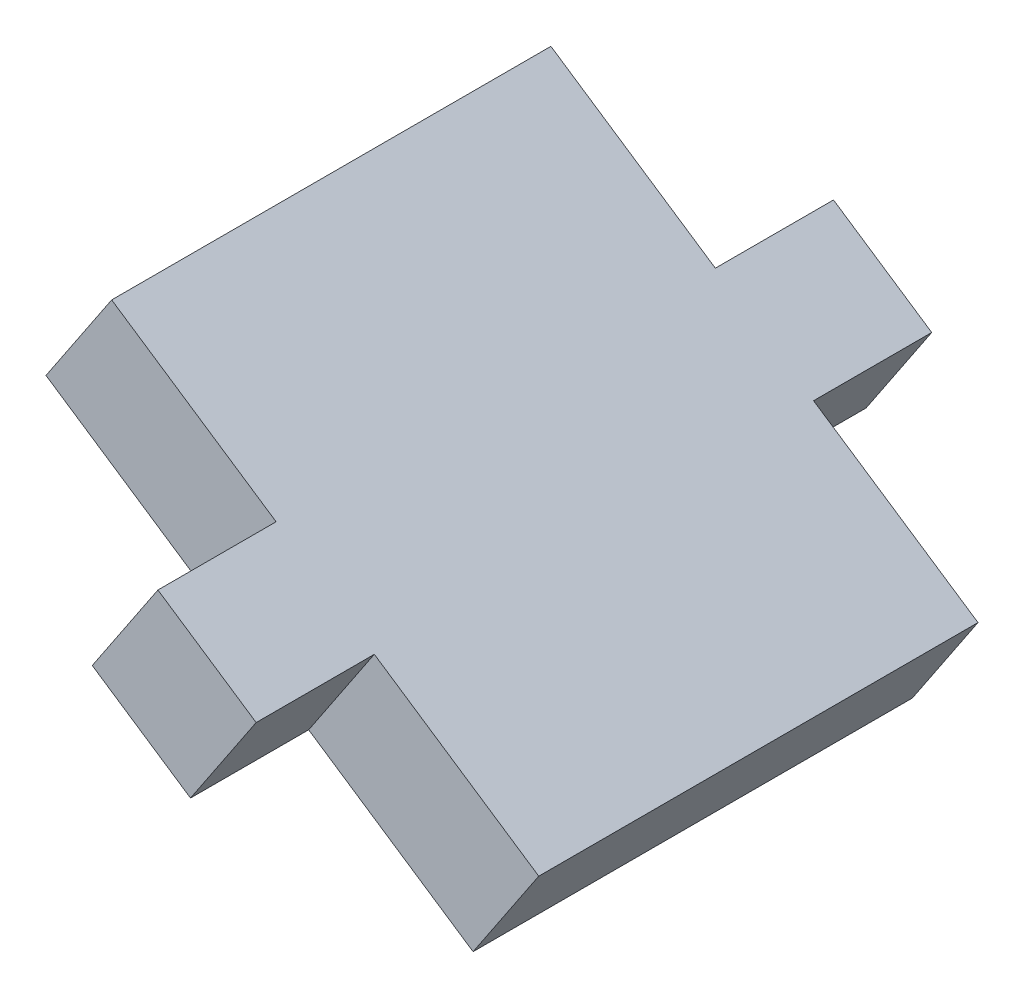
ISO-10303-21;
HEADER;
FILE_DESCRIPTION(('STEP AP214'),'2;1');
FILE_NAME('part.step','',(''),(''),'','','');
FILE_SCHEMA(('AUTOMOTIVE_DESIGN { 1 0 10303 214 1 1 1 1 }'));
ENDSEC;
DATA;
#1=APPLICATION_CONTEXT('core data for automotive mechanical design processes');
#2=APPLICATION_PROTOCOL_DEFINITION('international standard','automotive_design',2000,#1);
#3=PRODUCT_CONTEXT('',#1,'mechanical');
#4=PRODUCT('Part','Part','',(#3));
#5=PRODUCT_RELATED_PRODUCT_CATEGORY('part','',(#4));
#6=PRODUCT_DEFINITION_FORMATION('','',#4);
#7=PRODUCT_DEFINITION_CONTEXT('part definition',#1,'design');
#8=PRODUCT_DEFINITION('design','',#6,#7);
#9=PRODUCT_DEFINITION_SHAPE('','',#8);
#10=(LENGTH_UNIT() NAMED_UNIT(*) SI_UNIT(.MILLI.,.METRE.));
#11=(NAMED_UNIT(*) PLANE_ANGLE_UNIT() SI_UNIT($,.RADIAN.));
#12=(NAMED_UNIT(*) SI_UNIT($,.STERADIAN.) SOLID_ANGLE_UNIT());
#13=UNCERTAINTY_MEASURE_WITH_UNIT(LENGTH_MEASURE(1.E-05),#10,'distance_accuracy_value','');
#14=(GEOMETRIC_REPRESENTATION_CONTEXT(3) GLOBAL_UNCERTAINTY_ASSIGNED_CONTEXT((#13)) GLOBAL_UNIT_ASSIGNED_CONTEXT((#10,
#11,#12)) REPRESENTATION_CONTEXT('',''));
#15=CARTESIAN_POINT('',(0.,0.,0.));
#16=DIRECTION('',(0.,0.,1.));
#17=DIRECTION('',(1.,0.,0.));
#18=AXIS2_PLACEMENT_3D('',#15,#16,#17);
#19=CARTESIAN_POINT('',(0.,0.,-20.0152));
#20=DIRECTION('',(0.,0.,-1.));
#21=DIRECTION('',(-1.,0.,0.));
#22=AXIS2_PLACEMENT_3D('',#19,#20,#21);
#23=PLANE('',#22);
#24=DIRECTION('',(0.555746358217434,0.831351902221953,0.));
#25=VECTOR('',#24,1.);
#26=CARTESIAN_POINT('',(-748.95505416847,311.088970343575,-20.0152));
#27=LINE('',#26,#25);
#28=CARTESIAN_POINT('',(-748.95505416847,311.088970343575,-20.0152));
#29=VERTEX_POINT('',#28);
#30=CARTESIAN_POINT('',(-745.962471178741,315.56563406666,-20.0152));
#31=VERTEX_POINT('',#30);
#32=EDGE_CURVE('E49',#29,#31,#27,.T.);
#33=ORIENTED_EDGE('',*,*,#32,.F.);
#34=DIRECTION('',(0.83135190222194,-0.555746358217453,0.));
#35=VECTOR('',#34,1.);
#36=CARTESIAN_POINT('',(-756.447535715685,316.097582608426,-20.0152));
#37=LINE('',#36,#35);
#38=CARTESIAN_POINT('',(-756.447535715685,316.097582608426,-20.0152));
#39=VERTEX_POINT('',#38);
#40=EDGE_CURVE('E211',#39,#29,#37,.T.);
#41=ORIENTED_EDGE('',*,*,#40,.F.);
#42=DIRECTION('',(0.555746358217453,0.83135190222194,0.));
#43=VECTOR('',#42,1.);
#44=CARTESIAN_POINT('',(-756.447535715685,316.097582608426,-20.0152));
#45=LINE('',#44,#43);
#46=CARTESIAN_POINT('',(-753.454952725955,320.574246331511,-20.0152));
#47=VERTEX_POINT('',#46);
#48=EDGE_CURVE('E199',#39,#47,#45,.T.);
#49=ORIENTED_EDGE('',*,*,#48,.T.);
#50=DIRECTION('',(0.83135190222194,-0.555746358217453,0.));
#51=VECTOR('',#50,1.);
#52=CARTESIAN_POINT('',(-753.454952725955,320.574246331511,-20.0152));
#53=LINE('',#52,#51);
#54=EDGE_CURVE('E192',#47,#31,#53,.T.);
#55=ORIENTED_EDGE('',*,*,#54,.T.);
#56=EDGE_LOOP('',(#33,#41,#49,#55));
#57=FACE_BOUND('',#56,.T.);
#58=ADVANCED_FACE('F32',(#57),#23,.T.);
#59=CARTESIAN_POINT('',(0.,0.,0.));
#60=DIRECTION('',(0.,0.,-1.));
#61=DIRECTION('',(-1.,0.,0.));
#62=AXIS2_PLACEMENT_3D('',#59,#60,#61);
#63=PLANE('',#62);
#64=DIRECTION('',(-0.555746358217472,-0.831351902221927,0.));
#65=VECTOR('',#64,1.);
#66=CARTESIAN_POINT('',(-748.955053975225,311.088970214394,0.));
#67=LINE('',#66,#65);
#68=CARTESIAN_POINT('',(-745.962470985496,315.565633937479,0.));
#69=VERTEX_POINT('',#68);
#70=CARTESIAN_POINT('',(-748.955053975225,311.088970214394,0.));
#71=VERTEX_POINT('',#70);
#72=EDGE_CURVE('E148',#69,#71,#67,.T.);
#73=ORIENTED_EDGE('',*,*,#72,.F.);
#74=DIRECTION('',(0.83135190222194,-0.555746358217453,0.));
#75=VECTOR('',#74,1.);
#76=CARTESIAN_POINT('',(-753.454952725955,320.574246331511,0.));
#77=LINE('',#76,#75);
#78=CARTESIAN_POINT('',(-753.454952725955,320.574246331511,0.));
#79=VERTEX_POINT('',#78);
#80=EDGE_CURVE('E242',#79,#69,#77,.T.);
#81=ORIENTED_EDGE('',*,*,#80,.F.);
#82=DIRECTION('',(0.555746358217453,0.83135190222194,0.));
#83=VECTOR('',#82,1.);
#84=CARTESIAN_POINT('',(-756.447535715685,316.097582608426,0.));
#85=LINE('',#84,#83);
#86=CARTESIAN_POINT('',(-756.447535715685,316.097582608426,0.));
#87=VERTEX_POINT('',#86);
#88=EDGE_CURVE('E206',#87,#79,#85,.T.);
#89=ORIENTED_EDGE('',*,*,#88,.F.);
#90=DIRECTION('',(0.83135190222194,-0.555746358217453,0.));
#91=VECTOR('',#90,1.);
#92=CARTESIAN_POINT('',(-756.447535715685,316.097582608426,0.));
#93=LINE('',#92,#91);
#94=EDGE_CURVE('E235',#87,#71,#93,.T.);
#95=ORIENTED_EDGE('',*,*,#94,.T.);
#96=EDGE_LOOP('',(#73,#81,#89,#95));
#97=FACE_BOUND('',#96,.T.);
#98=ADVANCED_FACE('F278',(#97),#63,.F.);
#99=DIRECTION('',(0.555746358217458,0.831351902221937,0.));
#100=VECTOR('',#99,1.);
#101=CARTESIAN_POINT('',(-744.478390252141,308.096387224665,0.));
#102=LINE('',#101,#100);
#103=CARTESIAN_POINT('',(-744.478390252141,308.096387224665,0.));
#104=VERTEX_POINT('',#103);
#105=CARTESIAN_POINT('',(-741.485807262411,312.573050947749,0.));
#106=VERTEX_POINT('',#105);
#107=EDGE_CURVE('E151',#104,#106,#102,.T.);
#108=ORIENTED_EDGE('',*,*,#107,.F.);
#109=CARTESIAN_POINT('',(-736.985908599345,303.087774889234,0.));
#110=VERTEX_POINT('',#109);
#111=EDGE_CURVE('E237',#104,#110,#93,.T.);
#112=ORIENTED_EDGE('',*,*,#111,.T.);
#113=DIRECTION('',(-0.555746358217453,-0.83135190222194,0.));
#114=VECTOR('',#113,1.);
#115=CARTESIAN_POINT('',(-733.993325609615,307.564438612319,0.));
#116=LINE('',#115,#114);
#117=CARTESIAN_POINT('',(-733.993325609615,307.564438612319,0.));
#118=VERTEX_POINT('',#117);
#119=EDGE_CURVE('E230',#118,#110,#116,.T.);
#120=ORIENTED_EDGE('',*,*,#119,.F.);
#121=EDGE_CURVE('E246',#106,#118,#77,.T.);
#122=ORIENTED_EDGE('',*,*,#121,.F.);
#123=EDGE_LOOP('',(#108,#112,#120,#122));
#124=FACE_BOUND('',#123,.T.);
#125=ADVANCED_FACE('F276',(#124),#63,.F.);
#126=CARTESIAN_POINT('',(-756.447535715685,316.097582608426,-20.0152));
#127=DIRECTION('',(0.83135190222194,-0.555746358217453,0.));
#128=DIRECTION('',(0.555746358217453,0.83135190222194,0.));
#129=AXIS2_PLACEMENT_3D('',#126,#127,#128);
#130=PLANE('',#129);
#131=ORIENTED_EDGE('',*,*,#88,.T.);
#132=DIRECTION('',(0.,0.,1.));
#133=VECTOR('',#132,1.);
#134=CARTESIAN_POINT('',(-753.454952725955,320.574246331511,-20.0152));
#135=LINE('',#134,#133);
#136=EDGE_CURVE('E11',#47,#79,#135,.T.);
#137=ORIENTED_EDGE('',*,*,#136,.F.);
#138=ORIENTED_EDGE('',*,*,#48,.F.);
#139=DIRECTION('',(0.,0.,1.));
#140=VECTOR('',#139,1.);
#141=CARTESIAN_POINT('',(-756.447535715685,316.097582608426,-20.0152));
#142=LINE('',#141,#140);
#143=EDGE_CURVE('E212',#39,#87,#142,.T.);
#144=ORIENTED_EDGE('',*,*,#143,.T.);
#145=EDGE_LOOP('',(#131,#137,#138,#144));
#146=FACE_BOUND('',#145,.T.);
#147=ADVANCED_FACE('F34',(#146),#130,.F.);
#148=CARTESIAN_POINT('',(-753.454952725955,320.574246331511,-20.0152));
#149=DIRECTION('',(-0.555746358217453,-0.83135190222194,0.));
#150=DIRECTION('',(0.83135190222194,-0.555746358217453,0.));
#151=AXIS2_PLACEMENT_3D('',#148,#149,#150);
#152=PLANE('',#151);
#153=ORIENTED_EDGE('',*,*,#80,.T.);
#154=DIRECTION('',(0.,0.,-1.));
#155=VECTOR('',#154,1.);
#156=CARTESIAN_POINT('',(-745.962470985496,315.565633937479,5.3848));
#157=LINE('',#156,#155);
#158=CARTESIAN_POINT('',(-745.962470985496,315.565633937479,5.3848));
#159=VERTEX_POINT('',#158);
#160=EDGE_CURVE('E178',#159,#69,#157,.T.);
#161=ORIENTED_EDGE('',*,*,#160,.F.);
#162=DIRECTION('',(-0.831351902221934,0.555746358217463,0.));
#163=VECTOR('',#162,1.);
#164=CARTESIAN_POINT('',(-741.485807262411,312.573050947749,5.3848));
#165=LINE('',#164,#163);
#166=CARTESIAN_POINT('',(-741.485807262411,312.573050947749,5.3848));
#167=VERTEX_POINT('',#166);
#168=EDGE_CURVE('E176',#167,#159,#165,.T.);
#169=ORIENTED_EDGE('',*,*,#168,.F.);
#170=DIRECTION('',(0.,0.,-1.));
#171=VECTOR('',#170,1.);
#172=CARTESIAN_POINT('',(-741.485807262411,312.573050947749,5.3848));
#173=LINE('',#172,#171);
#174=EDGE_CURVE('E189',#167,#106,#173,.T.);
#175=ORIENTED_EDGE('',*,*,#174,.T.);
#176=ORIENTED_EDGE('',*,*,#121,.T.);
#177=DIRECTION('',(0.,0.,1.));
#178=VECTOR('',#177,1.);
#179=CARTESIAN_POINT('',(-733.993325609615,307.564438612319,-20.0152));
#180=LINE('',#179,#178);
#181=CARTESIAN_POINT('',(-733.993325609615,307.564438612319,-20.0152));
#182=VERTEX_POINT('',#181);
#183=EDGE_CURVE('E41',#182,#118,#180,.T.);
#184=ORIENTED_EDGE('',*,*,#183,.F.);
#185=CARTESIAN_POINT('',(-741.485807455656,312.573051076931,-20.0152));
#186=VERTEX_POINT('',#185);
#187=EDGE_CURVE('E147',#186,#182,#53,.T.);
#188=ORIENTED_EDGE('',*,*,#187,.F.);
#189=DIRECTION('',(0.,0.,1.));
#190=VECTOR('',#189,1.);
#191=CARTESIAN_POINT('',(-741.485807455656,312.573051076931,-25.4));
#192=LINE('',#191,#190);
#193=CARTESIAN_POINT('',(-741.485807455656,312.573051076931,-25.4));
#194=VERTEX_POINT('',#193);
#195=EDGE_CURVE('E128',#194,#186,#192,.T.);
#196=ORIENTED_EDGE('',*,*,#195,.F.);
#197=DIRECTION('',(0.831351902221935,-0.555746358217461,0.));
#198=VECTOR('',#197,1.);
#199=CARTESIAN_POINT('',(-745.962471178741,315.56563406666,-25.4));
#200=LINE('',#199,#198);
#201=CARTESIAN_POINT('',(-745.962471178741,315.56563406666,-25.4));
#202=VERTEX_POINT('',#201);
#203=EDGE_CURVE('E134',#202,#194,#200,.T.);
#204=ORIENTED_EDGE('',*,*,#203,.F.);
#205=DIRECTION('',(0.,0.,1.));
#206=VECTOR('',#205,1.);
#207=CARTESIAN_POINT('',(-745.962471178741,315.56563406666,-25.4));
#208=LINE('',#207,#206);
#209=EDGE_CURVE('E162',#202,#31,#208,.T.);
#210=ORIENTED_EDGE('',*,*,#209,.T.);
#211=ORIENTED_EDGE('',*,*,#54,.F.);
#212=ORIENTED_EDGE('',*,*,#136,.T.);
#213=EDGE_LOOP('',(#153,#161,#169,#175,#176,#184,#188,#196,#204,#210,#211,#212));
#214=FACE_BOUND('',#213,.T.);
#215=ADVANCED_FACE('F145',(#214),#152,.F.);
#216=CARTESIAN_POINT('',(-733.993325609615,307.564438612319,-20.0152));
#217=DIRECTION('',(-0.83135190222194,0.555746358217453,0.));
#218=DIRECTION('',(-0.555746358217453,-0.83135190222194,0.));
#219=AXIS2_PLACEMENT_3D('',#216,#217,#218);
#220=PLANE('',#219);
#221=ORIENTED_EDGE('',*,*,#119,.T.);
#222=DIRECTION('',(0.,0.,1.));
#223=VECTOR('',#222,1.);
#224=CARTESIAN_POINT('',(-736.985908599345,303.087774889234,-20.0152));
#225=LINE('',#224,#223);
#226=CARTESIAN_POINT('',(-736.985908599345,303.087774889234,-20.0152));
#227=VERTEX_POINT('',#226);
#228=EDGE_CURVE('E216',#227,#110,#225,.T.);
#229=ORIENTED_EDGE('',*,*,#228,.F.);
#230=DIRECTION('',(-0.555746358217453,-0.83135190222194,0.));
#231=VECTOR('',#230,1.);
#232=CARTESIAN_POINT('',(-733.993325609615,307.564438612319,-20.0152));
#233=LINE('',#232,#231);
#234=EDGE_CURVE('E195',#182,#227,#233,.T.);
#235=ORIENTED_EDGE('',*,*,#234,.F.);
#236=ORIENTED_EDGE('',*,*,#183,.T.);
#237=EDGE_LOOP('',(#221,#229,#235,#236));
#238=FACE_BOUND('',#237,.T.);
#239=ADVANCED_FACE('F228',(#238),#220,.F.);
#240=CARTESIAN_POINT('',(-756.447535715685,316.097582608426,-20.0152));
#241=DIRECTION('',(-0.555746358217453,-0.83135190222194,0.));
#242=DIRECTION('',(0.83135190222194,-0.555746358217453,0.));
#243=AXIS2_PLACEMENT_3D('',#240,#241,#242);
#244=PLANE('',#243);
#245=ORIENTED_EDGE('',*,*,#94,.F.);
#246=ORIENTED_EDGE('',*,*,#143,.F.);
#247=ORIENTED_EDGE('',*,*,#40,.T.);
#248=DIRECTION('',(0.,0.,1.));
#249=VECTOR('',#248,1.);
#250=CARTESIAN_POINT('',(-748.95505416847,311.088970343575,-25.4));
#251=LINE('',#250,#249);
#252=CARTESIAN_POINT('',(-748.95505416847,311.088970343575,-25.4));
#253=VERTEX_POINT('',#252);
#254=EDGE_CURVE('E153',#253,#29,#251,.T.);
#255=ORIENTED_EDGE('',*,*,#254,.F.);
#256=DIRECTION('',(-0.83135190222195,0.555746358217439,0.));
#257=VECTOR('',#256,1.);
#258=CARTESIAN_POINT('',(-744.478390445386,308.096387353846,-25.4));
#259=LINE('',#258,#257);
#260=CARTESIAN_POINT('',(-744.478390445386,308.096387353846,-25.4));
#261=VERTEX_POINT('',#260);
#262=EDGE_CURVE('E133',#261,#253,#259,.T.);
#263=ORIENTED_EDGE('',*,*,#262,.F.);
#264=DIRECTION('',(0.,0.,1.));
#265=VECTOR('',#264,1.);
#266=CARTESIAN_POINT('',(-744.478390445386,308.096387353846,-25.4));
#267=LINE('',#266,#265);
#268=CARTESIAN_POINT('',(-744.478390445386,308.096387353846,-20.0152));
#269=VERTEX_POINT('',#268);
#270=EDGE_CURVE('E130',#261,#269,#267,.T.);
#271=ORIENTED_EDGE('',*,*,#270,.T.);
#272=EDGE_CURVE('E203',#269,#227,#37,.T.);
#273=ORIENTED_EDGE('',*,*,#272,.T.);
#274=ORIENTED_EDGE('',*,*,#228,.T.);
#275=ORIENTED_EDGE('',*,*,#111,.F.);
#276=DIRECTION('',(0.,0.,-1.));
#277=VECTOR('',#276,1.);
#278=CARTESIAN_POINT('',(-744.478390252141,308.096387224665,5.3848));
#279=LINE('',#278,#277);
#280=CARTESIAN_POINT('',(-744.478390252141,308.096387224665,5.3848));
#281=VERTEX_POINT('',#280);
#282=EDGE_CURVE('E256',#281,#104,#279,.T.);
#283=ORIENTED_EDGE('',*,*,#282,.F.);
#284=DIRECTION('',(0.83135190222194,-0.555746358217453,0.));
#285=VECTOR('',#284,1.);
#286=CARTESIAN_POINT('',(-748.955053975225,311.088970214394,5.3848));
#287=LINE('',#286,#285);
#288=CARTESIAN_POINT('',(-748.955053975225,311.088970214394,5.3848));
#289=VERTEX_POINT('',#288);
#290=EDGE_CURVE('E172',#289,#281,#287,.T.);
#291=ORIENTED_EDGE('',*,*,#290,.F.);
#292=DIRECTION('',(0.,0.,-1.));
#293=VECTOR('',#292,1.);
#294=CARTESIAN_POINT('',(-748.955053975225,311.088970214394,5.3848));
#295=LINE('',#294,#293);
#296=EDGE_CURVE('E251',#289,#71,#295,.T.);
#297=ORIENTED_EDGE('',*,*,#296,.T.);
#298=EDGE_LOOP('',(#245,#246,#247,#255,#263,#271,#273,#274,#275,#283,#291,#297));
#299=FACE_BOUND('',#298,.T.);
#300=ADVANCED_FACE('F220',(#299),#244,.T.);
#301=DIRECTION('',(-0.555746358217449,-0.831351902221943,0.));
#302=VECTOR('',#301,1.);
#303=CARTESIAN_POINT('',(-741.485807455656,312.573051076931,-20.0152));
#304=LINE('',#303,#302);
#305=EDGE_CURVE('E57',#186,#269,#304,.T.);
#306=ORIENTED_EDGE('',*,*,#305,.F.);
#307=ORIENTED_EDGE('',*,*,#187,.T.);
#308=ORIENTED_EDGE('',*,*,#234,.T.);
#309=ORIENTED_EDGE('',*,*,#272,.F.);
#310=EDGE_LOOP('',(#306,#307,#308,#309));
#311=FACE_BOUND('',#310,.T.);
#312=ADVANCED_FACE('F225',(#311),#23,.T.);
#313=CARTESIAN_POINT('',(-748.955053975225,311.088970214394,5.3848));
#314=DIRECTION('',(0.831351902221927,-0.555746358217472,0.));
#315=DIRECTION('',(0.555746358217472,0.831351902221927,0.));
#316=AXIS2_PLACEMENT_3D('',#313,#314,#315);
#317=PLANE('',#316);
#318=ORIENTED_EDGE('',*,*,#72,.T.);
#319=ORIENTED_EDGE('',*,*,#296,.F.);
#320=DIRECTION('',(-0.555746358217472,-0.831351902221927,0.));
#321=VECTOR('',#320,1.);
#322=CARTESIAN_POINT('',(-748.955053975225,311.088970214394,5.3848));
#323=LINE('',#322,#321);
#324=EDGE_CURVE('E169',#159,#289,#323,.T.);
#325=ORIENTED_EDGE('',*,*,#324,.F.);
#326=ORIENTED_EDGE('',*,*,#160,.T.);
#327=EDGE_LOOP('',(#318,#319,#325,#326));
#328=FACE_BOUND('',#327,.T.);
#329=ADVANCED_FACE('F292',(#328),#317,.F.);
#330=CARTESIAN_POINT('',(-744.478390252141,308.096387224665,5.3848));
#331=DIRECTION('',(-0.831351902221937,0.555746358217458,0.));
#332=DIRECTION('',(-0.555746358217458,-0.831351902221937,0.));
#333=AXIS2_PLACEMENT_3D('',#330,#331,#332);
#334=PLANE('',#333);
#335=ORIENTED_EDGE('',*,*,#107,.T.);
#336=ORIENTED_EDGE('',*,*,#174,.F.);
#337=DIRECTION('',(0.555746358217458,0.831351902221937,0.));
#338=VECTOR('',#337,1.);
#339=CARTESIAN_POINT('',(-744.478390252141,308.096387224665,5.3848));
#340=LINE('',#339,#338);
#341=EDGE_CURVE('E174',#281,#167,#340,.T.);
#342=ORIENTED_EDGE('',*,*,#341,.F.);
#343=ORIENTED_EDGE('',*,*,#282,.T.);
#344=EDGE_LOOP('',(#335,#336,#342,#343));
#345=FACE_BOUND('',#344,.T.);
#346=ADVANCED_FACE('F268',(#345),#334,.F.);
#347=CARTESIAN_POINT('',(0.,0.,5.3848));
#348=DIRECTION('',(0.,0.,1.));
#349=DIRECTION('',(1.,0.,0.));
#350=AXIS2_PLACEMENT_3D('',#347,#348,#349);
#351=PLANE('',#350);
#352=ORIENTED_EDGE('',*,*,#324,.T.);
#353=ORIENTED_EDGE('',*,*,#290,.T.);
#354=ORIENTED_EDGE('',*,*,#341,.T.);
#355=ORIENTED_EDGE('',*,*,#168,.T.);
#356=EDGE_LOOP('',(#352,#353,#354,#355));
#357=FACE_BOUND('',#356,.T.);
#358=ADVANCED_FACE('F275',(#357),#351,.T.);
#359=CARTESIAN_POINT('',(-741.485807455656,312.573051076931,-25.4));
#360=DIRECTION('',(-0.831351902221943,0.555746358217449,0.));
#361=DIRECTION('',(-0.555746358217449,-0.831351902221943,0.));
#362=AXIS2_PLACEMENT_3D('',#359,#360,#361);
#363=PLANE('',#362);
#364=ORIENTED_EDGE('',*,*,#305,.T.);
#365=ORIENTED_EDGE('',*,*,#270,.F.);
#366=DIRECTION('',(-0.555746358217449,-0.831351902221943,0.));
#367=VECTOR('',#366,1.);
#368=CARTESIAN_POINT('',(-741.485807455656,312.573051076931,-25.4));
#369=LINE('',#368,#367);
#370=EDGE_CURVE('E124',#194,#261,#369,.T.);
#371=ORIENTED_EDGE('',*,*,#370,.F.);
#372=ORIENTED_EDGE('',*,*,#195,.T.);
#373=EDGE_LOOP('',(#364,#365,#371,#372));
#374=FACE_BOUND('',#373,.T.);
#375=ADVANCED_FACE('F126',(#374),#363,.F.);
#376=CARTESIAN_POINT('',(-748.95505416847,311.088970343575,-25.4));
#377=DIRECTION('',(0.831351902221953,-0.555746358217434,0.));
#378=DIRECTION('',(0.555746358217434,0.831351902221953,0.));
#379=AXIS2_PLACEMENT_3D('',#376,#377,#378);
#380=PLANE('',#379);
#381=ORIENTED_EDGE('',*,*,#32,.T.);
#382=ORIENTED_EDGE('',*,*,#209,.F.);
#383=DIRECTION('',(0.555746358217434,0.831351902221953,0.));
#384=VECTOR('',#383,1.);
#385=CARTESIAN_POINT('',(-748.95505416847,311.088970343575,-25.4));
#386=LINE('',#385,#384);
#387=EDGE_CURVE('E139',#253,#202,#386,.T.);
#388=ORIENTED_EDGE('',*,*,#387,.F.);
#389=ORIENTED_EDGE('',*,*,#254,.T.);
#390=EDGE_LOOP('',(#381,#382,#388,#389));
#391=FACE_BOUND('',#390,.T.);
#392=ADVANCED_FACE('F374',(#391),#380,.F.);
#393=CARTESIAN_POINT('',(0.,0.,-25.4));
#394=DIRECTION('',(0.,0.,-1.));
#395=DIRECTION('',(-1.,0.,0.));
#396=AXIS2_PLACEMENT_3D('',#393,#394,#395);
#397=PLANE('',#396);
#398=ORIENTED_EDGE('',*,*,#203,.T.);
#399=ORIENTED_EDGE('',*,*,#370,.T.);
#400=ORIENTED_EDGE('',*,*,#262,.T.);
#401=ORIENTED_EDGE('',*,*,#387,.T.);
#402=EDGE_LOOP('',(#398,#399,#400,#401));
#403=FACE_BOUND('',#402,.T.);
#404=ADVANCED_FACE('F137',(#403),#397,.T.);
#405=CLOSED_SHELL('',(#58,#98,#125,#147,#215,#239,#300,#312,#329,#346,#358,#375,#392,#404));
#406=MANIFOLD_SOLID_BREP('B2',#405);
#407=ADVANCED_BREP_SHAPE_REPRESENTATION('',(#18,#406),#14);
#408=SHAPE_DEFINITION_REPRESENTATION(#9,#407);
ENDSEC;
END-ISO-10303-21;
